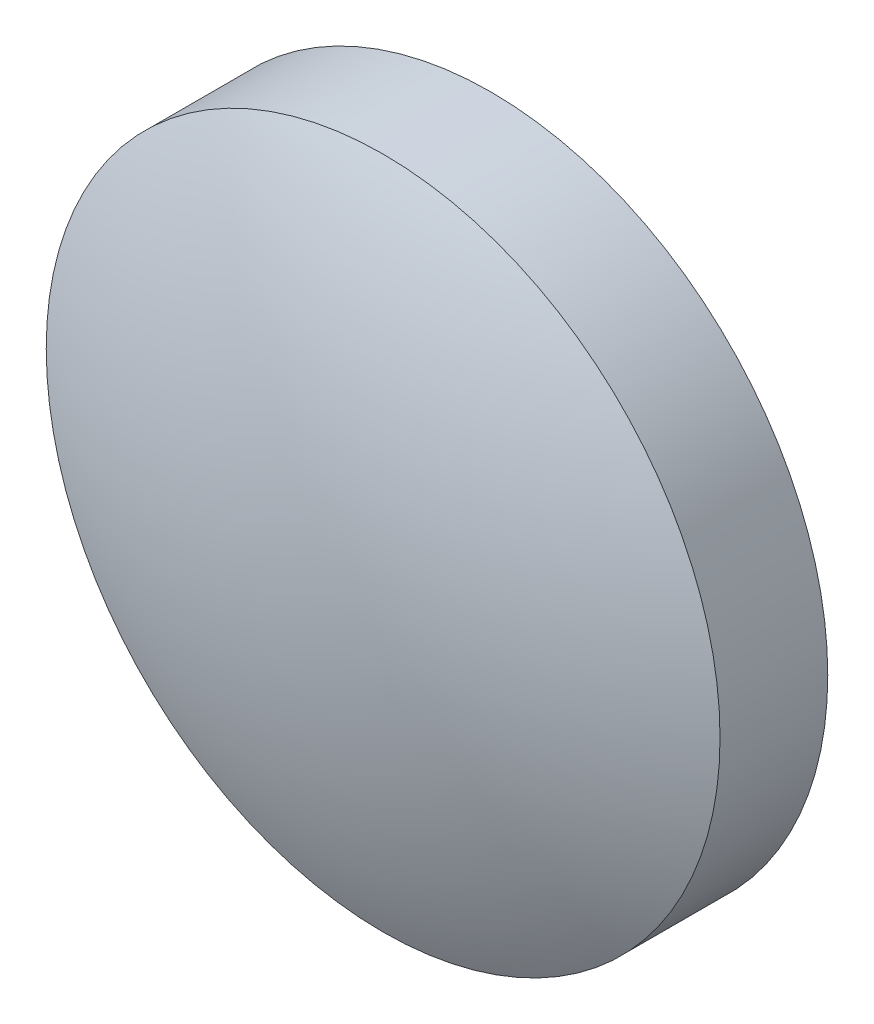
ISO-10303-21;
HEADER;
FILE_DESCRIPTION(('STEP AP214'),'2;1');
FILE_NAME('part.step','',(''),(''),'','','');
FILE_SCHEMA(('AUTOMOTIVE_DESIGN { 1 0 10303 214 1 1 1 1 }'));
ENDSEC;
DATA;
#1=APPLICATION_CONTEXT('core data for automotive mechanical design processes');
#2=APPLICATION_PROTOCOL_DEFINITION('international standard','automotive_design',2000,#1);
#3=PRODUCT_CONTEXT('',#1,'mechanical');
#4=PRODUCT('Part','Part','',(#3));
#5=PRODUCT_RELATED_PRODUCT_CATEGORY('part','',(#4));
#6=PRODUCT_DEFINITION_FORMATION('','',#4);
#7=PRODUCT_DEFINITION_CONTEXT('part definition',#1,'design');
#8=PRODUCT_DEFINITION('design','',#6,#7);
#9=PRODUCT_DEFINITION_SHAPE('','',#8);
#10=(LENGTH_UNIT() NAMED_UNIT(*) SI_UNIT(.MILLI.,.METRE.));
#11=(NAMED_UNIT(*) PLANE_ANGLE_UNIT() SI_UNIT($,.RADIAN.));
#12=(NAMED_UNIT(*) SI_UNIT($,.STERADIAN.) SOLID_ANGLE_UNIT());
#13=UNCERTAINTY_MEASURE_WITH_UNIT(LENGTH_MEASURE(1.E-05),#10,'distance_accuracy_value','');
#14=(GEOMETRIC_REPRESENTATION_CONTEXT(3) GLOBAL_UNCERTAINTY_ASSIGNED_CONTEXT((#13)) GLOBAL_UNIT_ASSIGNED_CONTEXT((#10,
#11,#12)) REPRESENTATION_CONTEXT('',''));
#15=CARTESIAN_POINT('',(0.,0.,0.));
#16=DIRECTION('',(0.,0.,1.));
#17=DIRECTION('',(1.,0.,0.));
#18=AXIS2_PLACEMENT_3D('',#15,#16,#17);
#19=CARTESIAN_POINT('',(0.,0.,15.56));
#20=DIRECTION('',(0.,-1.,0.));
#21=DIRECTION('',(0.,0.,-1.));
#22=AXIS2_PLACEMENT_3D('',#19,#20,#21);
#23=SPHERICAL_SURFACE('',#22,15.56);
#24=CARTESIAN_POINT('',(0.,0.,1.20334300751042));
#25=DIRECTION('',(0.,0.,1.));
#26=DIRECTION('',(1.,0.,0.));
#27=AXIS2_PLACEMENT_3D('',#24,#25,#26);
#28=CIRCLE('',#27,6.);
#29=CARTESIAN_POINT('',(6.,0.,1.20334300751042));
#30=VERTEX_POINT('',#29);
#31=EDGE_CURVE('E19',#30,#30,#28,.T.);
#32=ORIENTED_EDGE('',*,*,#31,.F.);
#33=EDGE_LOOP('',(#32));
#34=FACE_BOUND('',#33,.T.);
#35=ADVANCED_FACE('F15',(#34),#23,.T.);
#36=CARTESIAN_POINT('',(0.,0.,1.20334300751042));
#37=DIRECTION('',(0.,0.,1.));
#38=DIRECTION('',(1.,0.,0.));
#39=AXIS2_PLACEMENT_3D('',#36,#37,#38);
#40=CYLINDRICAL_SURFACE('',#39,6.);
#41=ORIENTED_EDGE('',*,*,#31,.T.);
#42=EDGE_LOOP('',(#41));
#43=FACE_BOUND('',#42,.T.);
#44=CARTESIAN_POINT('',(0.,0.,3.12184303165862));
#45=DIRECTION('',(0.,0.,1.));
#46=DIRECTION('',(1.,0.,0.));
#47=AXIS2_PLACEMENT_3D('',#44,#45,#46);
#48=CIRCLE('',#47,6.);
#49=CARTESIAN_POINT('',(6.,0.,3.12184303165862));
#50=VERTEX_POINT('',#49);
#51=EDGE_CURVE('E10',#50,#50,#48,.T.);
#52=ORIENTED_EDGE('',*,*,#51,.F.);
#53=EDGE_LOOP('',(#52));
#54=FACE_BOUND('',#53,.T.);
#55=ADVANCED_FACE('F32',(#43,#54),#40,.T.);
#56=CARTESIAN_POINT('',(0.,0.,-9.25000000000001));
#57=DIRECTION('',(0.,-1.,0.));
#58=DIRECTION('',(0.,0.,1.));
#59=AXIS2_PLACEMENT_3D('',#56,#57,#58);
#60=SPHERICAL_SURFACE('',#59,13.75);
#61=ORIENTED_EDGE('',*,*,#51,.T.);
#62=EDGE_LOOP('',(#61));
#63=FACE_BOUND('',#62,.T.);
#64=ADVANCED_FACE('F30',(#63),#60,.T.);
#65=CLOSED_SHELL('',(#35,#55,#64));
#66=MANIFOLD_SOLID_BREP('B1',#65);
#67=ADVANCED_BREP_SHAPE_REPRESENTATION('',(#18,#66),#14);
#68=SHAPE_DEFINITION_REPRESENTATION(#9,#67);
ENDSEC;
END-ISO-10303-21;
